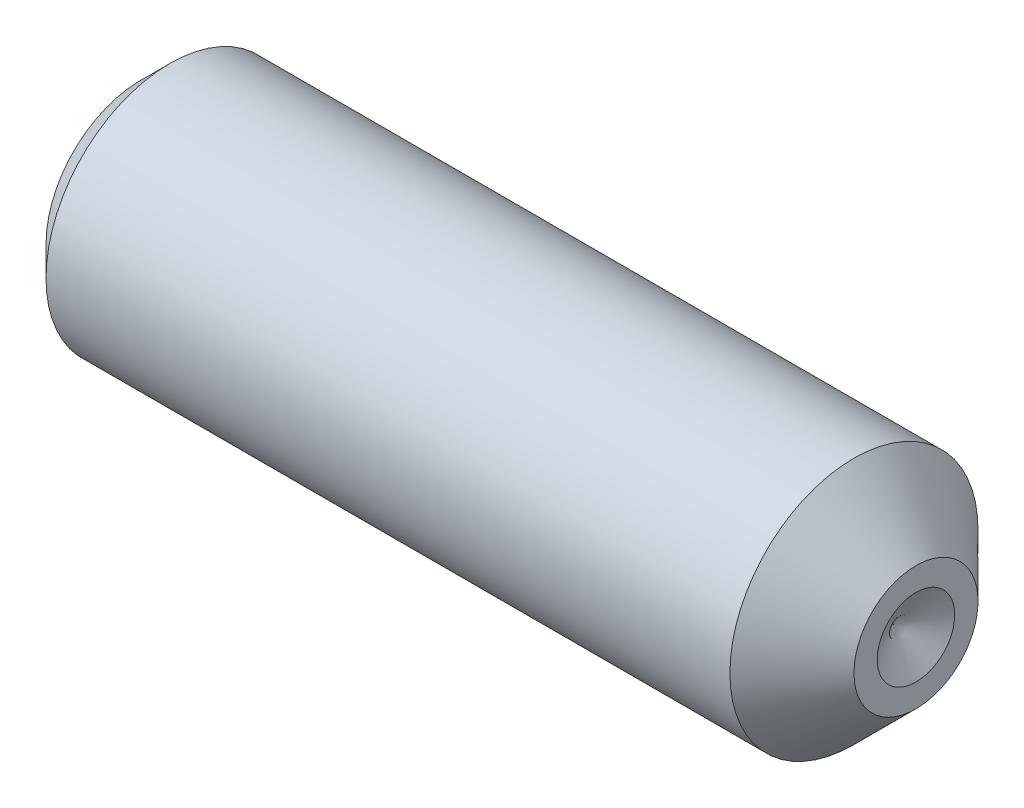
from build123d import *

# Parameters (mm, degrees)
HEXAGONSOCKET_DEPTH = 0.7


with BuildPart() as part:
    # Sketch1 → Base (revolve)
    with BuildSketch(Plane.XY, mode=Mode.PRIVATE) as base_sk:
        Polygon((0, 0), (5, 0), (5, 0.4), (4.6, 0.8), (0.1895, 0.8), (0, 0.6105), align=None)
    revolve(base_sk.sketch.rotate(Axis((-10.745014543, 0, 0), (1, 0, 0)), 90), axis=Axis((-10.745014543, 0, 0), (1, 0, 0)))

    # Sketch2 → HexagonSocket (cut)
    with BuildSketch(Plane(origin=(0, 0.180497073, -0.295782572), x_dir=(0, 0, 1), z_dir=(-1, 0, 0))):
        Polygon((0.69992776, -0.180497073), (0.497855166, 0.169502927), (0.093709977, 0.169502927), (-0.108362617, -0.180497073), (0.093709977, -0.530497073), (0.497855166, -0.530497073), align=None)
    extrude(amount=-HEXAGONSOCKET_DEPTH, mode=Mode.SUBTRACT)

    # Cut-Extrude1 cone 1 section (on through the dimple's axis) → Cut-Extrude1 (revolve, cut)
    with BuildSketch(Plane(origin=(5, 0, 0), x_dir=(0, 0, -1), z_dir=(0, 1, 0))):
        Polygon((0, 0), (0.25, 0), (0, 0.144337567), align=None)
    revolve(axis=Axis((5, 0, 0), (-1, 0, 0)), mode=Mode.SUBTRACT)

    # Sketch4 → Cut-Revolve1 (revolve, cut)
    with BuildSketch(Plane.XY, mode=Mode.PRIVATE) as cut_revolve1_sk:
        Polygon((0.7, 0.35), (0.902072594, 0), (0.7, 0), align=None)
    revolve(cut_revolve1_sk.sketch.rotate(Axis((0.237226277, 0, 0), (-1, 0, 0)), 270), axis=Axis((0.237226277, 0, 0), (-1, 0, 0)), mode=Mode.SUBTRACT)


solid = part.part
